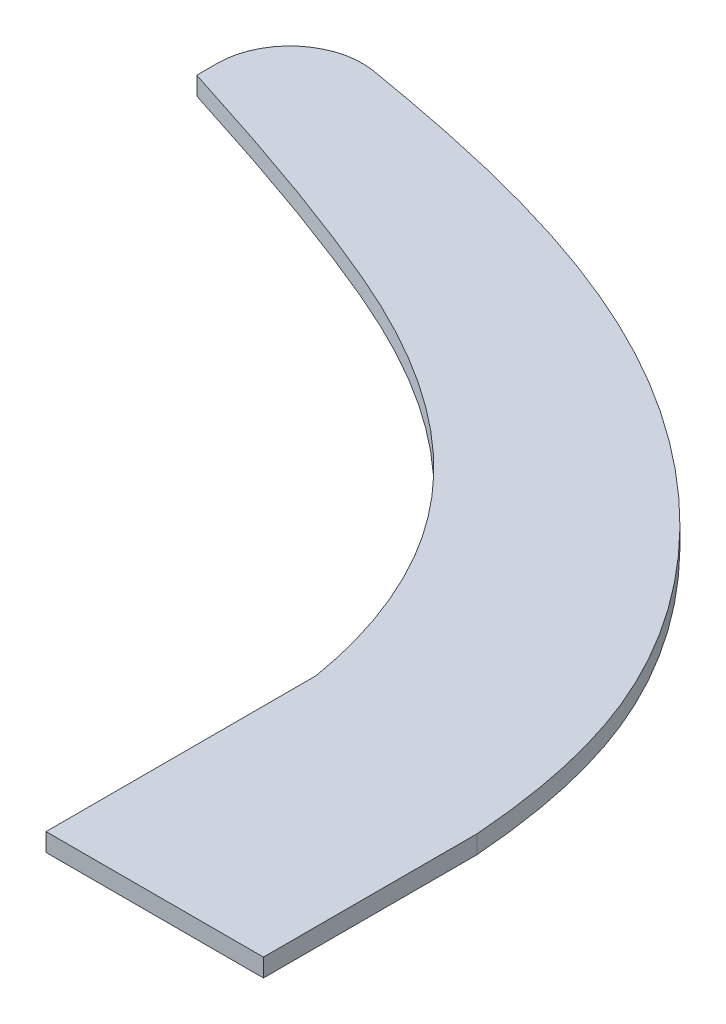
ISO-10303-21;
HEADER;
FILE_DESCRIPTION(('STEP AP214'),'2;1');
FILE_NAME('part.step','',(''),(''),'','','');
FILE_SCHEMA(('AUTOMOTIVE_DESIGN { 1 0 10303 214 1 1 1 1 }'));
ENDSEC;
DATA;
#1=APPLICATION_CONTEXT('core data for automotive mechanical design processes');
#2=APPLICATION_PROTOCOL_DEFINITION('international standard','automotive_design',2000,#1);
#3=PRODUCT_CONTEXT('',#1,'mechanical');
#4=PRODUCT('Part','Part','',(#3));
#5=PRODUCT_RELATED_PRODUCT_CATEGORY('part','',(#4));
#6=PRODUCT_DEFINITION_FORMATION('','',#4);
#7=PRODUCT_DEFINITION_CONTEXT('part definition',#1,'design');
#8=PRODUCT_DEFINITION('design','',#6,#7);
#9=PRODUCT_DEFINITION_SHAPE('','',#8);
#10=(LENGTH_UNIT() NAMED_UNIT(*) SI_UNIT(.MILLI.,.METRE.));
#11=(NAMED_UNIT(*) PLANE_ANGLE_UNIT() SI_UNIT($,.RADIAN.));
#12=(NAMED_UNIT(*) SI_UNIT($,.STERADIAN.) SOLID_ANGLE_UNIT());
#13=UNCERTAINTY_MEASURE_WITH_UNIT(LENGTH_MEASURE(1.E-05),#10,'distance_accuracy_value','');
#14=(GEOMETRIC_REPRESENTATION_CONTEXT(3) GLOBAL_UNCERTAINTY_ASSIGNED_CONTEXT((#13)) GLOBAL_UNIT_ASSIGNED_CONTEXT((#10,
#11,#12)) REPRESENTATION_CONTEXT('',''));
#15=CARTESIAN_POINT('',(0.,0.,0.));
#16=DIRECTION('',(0.,0.,1.));
#17=DIRECTION('',(1.,0.,0.));
#18=AXIS2_PLACEMENT_3D('',#15,#16,#17);
#19=CARTESIAN_POINT('',(-276.080212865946,6.35,-304.304256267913));
#20=CARTESIAN_POINT('',(-249.39702884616,6.35,-295.816675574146));
#21=CARTESIAN_POINT('',(-215.313087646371,6.35,-284.497873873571));
#22=CARTESIAN_POINT('',(-147.777683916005,6.35,-255.872844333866));
#23=CARTESIAN_POINT('',(-106.217359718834,6.35,-225.424204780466));
#24=CARTESIAN_POINT('',(-80.1625209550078,6.35,-174.044765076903));
#25=CARTESIAN_POINT('',(-75.0894864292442,6.35,-155.98481076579));
#26=CARTESIAN_POINT('',(-72.8802128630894,6.35,-142.977188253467));
#27=B_SPLINE_CURVE_WITH_KNOTS('',3,(#19,#20,#21,#22,#23,#24,#25,#26),.UNSPECIFIED.,.F.,.F.,(4,1,
1,1,1,4),(0.204924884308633,0.390633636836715,0.440251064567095,0.672116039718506,
0.710668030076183,0.796787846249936),.UNSPECIFIED.);
#28=DIRECTION('',(0.,-1.,0.));
#29=VECTOR('',#28,1.);
#30=SURFACE_OF_LINEAR_EXTRUSION('',#27,#29);
#31=CARTESIAN_POINT('',(-276.080212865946,0.,-304.304256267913));
#32=CARTESIAN_POINT('',(-249.39702884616,0.,-295.816675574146));
#33=CARTESIAN_POINT('',(-215.313087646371,0.,-284.497873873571));
#34=CARTESIAN_POINT('',(-147.777683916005,0.,-255.872844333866));
#35=CARTESIAN_POINT('',(-106.217359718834,0.,-225.424204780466));
#36=CARTESIAN_POINT('',(-80.1625209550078,0.,-174.044765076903));
#37=CARTESIAN_POINT('',(-75.0894864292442,0.,-155.98481076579));
#38=CARTESIAN_POINT('',(-72.8802128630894,0.,-142.977188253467));
#39=B_SPLINE_CURVE_WITH_KNOTS('',3,(#31,#32,#33,#34,#35,#36,#37,#38),.UNSPECIFIED.,.F.,.F.,(4,1,
1,1,1,4),(0.204924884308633,0.390633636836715,0.440251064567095,0.672116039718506,
0.710668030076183,0.796787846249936),.UNSPECIFIED.);
#40=CARTESIAN_POINT('',(-276.080212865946,0.,-304.304256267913));
#41=VERTEX_POINT('',#40);
#42=CARTESIAN_POINT('',(-72.8802128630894,0.,-142.977188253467));
#43=VERTEX_POINT('',#42);
#44=EDGE_CURVE('E125',#41,#43,#39,.T.);
#45=ORIENTED_EDGE('',*,*,#44,.T.);
#46=DIRECTION('',(0.,-1.,0.));
#47=VECTOR('',#46,1.);
#48=CARTESIAN_POINT('',(-72.8802128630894,6.35,-142.977188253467));
#49=LINE('',#48,#47);
#50=CARTESIAN_POINT('',(-72.8802128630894,6.35,-142.977188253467));
#51=VERTEX_POINT('',#50);
#52=EDGE_CURVE('E11',#51,#43,#49,.T.);
#53=ORIENTED_EDGE('',*,*,#52,.F.);
#54=CARTESIAN_POINT('',(-276.080212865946,6.35,-304.304256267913));
#55=VERTEX_POINT('',#54);
#56=EDGE_CURVE('E147',#55,#51,#27,.T.);
#57=ORIENTED_EDGE('',*,*,#56,.F.);
#58=DIRECTION('',(0.,-1.,0.));
#59=VECTOR('',#58,1.);
#60=CARTESIAN_POINT('',(-276.080212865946,6.35,-304.304256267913));
#61=LINE('',#60,#59);
#62=EDGE_CURVE('E118',#55,#41,#61,.T.);
#63=ORIENTED_EDGE('',*,*,#62,.T.);
#64=EDGE_LOOP('',(#45,#53,#57,#63));
#65=FACE_BOUND('',#64,.T.);
#66=ADVANCED_FACE('F31',(#65),#30,.F.);
#67=CARTESIAN_POINT('',(-72.8802128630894,6.35,-48.26));
#68=DIRECTION('',(1.,0.,0.));
#69=DIRECTION('',(0.,0.,-1.));
#70=AXIS2_PLACEMENT_3D('',#67,#68,#69);
#71=PLANE('',#70);
#72=DIRECTION('',(0.,0.,1.));
#73=VECTOR('',#72,1.);
#74=CARTESIAN_POINT('',(-72.8802128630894,0.,-48.26));
#75=LINE('',#74,#73);
#76=CARTESIAN_POINT('',(-72.8802128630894,0.,-48.26));
#77=VERTEX_POINT('',#76);
#78=EDGE_CURVE('E130',#43,#77,#75,.T.);
#79=ORIENTED_EDGE('',*,*,#78,.T.);
#80=DIRECTION('',(0.,-1.,0.));
#81=VECTOR('',#80,1.);
#82=CARTESIAN_POINT('',(-72.8802128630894,6.35,-48.26));
#83=LINE('',#82,#81);
#84=CARTESIAN_POINT('',(-72.8802128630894,6.35,-48.26));
#85=VERTEX_POINT('',#84);
#86=EDGE_CURVE('E40',#85,#77,#83,.T.);
#87=ORIENTED_EDGE('',*,*,#86,.F.);
#88=DIRECTION('',(0.,0.,1.));
#89=VECTOR('',#88,1.);
#90=CARTESIAN_POINT('',(-72.8802128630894,6.35,-48.26));
#91=LINE('',#90,#89);
#92=EDGE_CURVE('E88',#51,#85,#91,.T.);
#93=ORIENTED_EDGE('',*,*,#92,.F.);
#94=ORIENTED_EDGE('',*,*,#52,.T.);
#95=EDGE_LOOP('',(#79,#87,#93,#94));
#96=FACE_BOUND('',#95,.T.);
#97=ADVANCED_FACE('F177',(#96),#71,.F.);
#98=CARTESIAN_POINT('',(3.31978713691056,6.35,-48.26));
#99=DIRECTION('',(0.,0.,-1.));
#100=DIRECTION('',(-1.,0.,0.));
#101=AXIS2_PLACEMENT_3D('',#98,#99,#100);
#102=PLANE('',#101);
#103=DIRECTION('',(1.,0.,0.));
#104=VECTOR('',#103,1.);
#105=CARTESIAN_POINT('',(3.31978713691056,0.,-48.26));
#106=LINE('',#105,#104);
#107=CARTESIAN_POINT('',(3.31978713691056,0.,-48.26));
#108=VERTEX_POINT('',#107);
#109=EDGE_CURVE('E135',#77,#108,#106,.T.);
#110=ORIENTED_EDGE('',*,*,#109,.T.);
#111=DIRECTION('',(0.,-1.,0.));
#112=VECTOR('',#111,1.);
#113=CARTESIAN_POINT('',(3.31978713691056,6.35,-48.26));
#114=LINE('',#113,#112);
#115=CARTESIAN_POINT('',(3.31978713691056,6.35,-48.26));
#116=VERTEX_POINT('',#115);
#117=EDGE_CURVE('E151',#116,#108,#114,.T.);
#118=ORIENTED_EDGE('',*,*,#117,.F.);
#119=DIRECTION('',(1.,0.,0.));
#120=VECTOR('',#119,1.);
#121=CARTESIAN_POINT('',(3.31978713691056,6.35,-48.26));
#122=LINE('',#121,#120);
#123=EDGE_CURVE('E159',#85,#116,#122,.T.);
#124=ORIENTED_EDGE('',*,*,#123,.F.);
#125=ORIENTED_EDGE('',*,*,#86,.T.);
#126=EDGE_LOOP('',(#110,#118,#124,#125));
#127=FACE_BOUND('',#126,.T.);
#128=ADVANCED_FACE('F157',(#127),#102,.F.);
#129=CARTESIAN_POINT('',(3.31978713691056,6.35,-48.26));
#130=DIRECTION('',(-1.,0.,0.));
#131=DIRECTION('',(0.,0.,1.));
#132=AXIS2_PLACEMENT_3D('',#129,#130,#131);
#133=PLANE('',#132);
#134=DIRECTION('',(0.,0.,-1.));
#135=VECTOR('',#134,1.);
#136=CARTESIAN_POINT('',(3.31978713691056,0.,-48.26));
#137=LINE('',#136,#135);
#138=CARTESIAN_POINT('',(3.31978713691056,0.,-123.182472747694));
#139=VERTEX_POINT('',#138);
#140=EDGE_CURVE('E137',#108,#139,#137,.T.);
#141=ORIENTED_EDGE('',*,*,#140,.T.);
#142=DIRECTION('',(0.,-1.,0.));
#143=VECTOR('',#142,1.);
#144=CARTESIAN_POINT('',(3.31978713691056,6.35,-123.182472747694));
#145=LINE('',#144,#143);
#146=CARTESIAN_POINT('',(3.31978713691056,6.35,-123.182472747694));
#147=VERTEX_POINT('',#146);
#148=EDGE_CURVE('E113',#147,#139,#145,.T.);
#149=ORIENTED_EDGE('',*,*,#148,.F.);
#150=DIRECTION('',(0.,0.,-1.));
#151=VECTOR('',#150,1.);
#152=CARTESIAN_POINT('',(3.31978713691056,6.35,-48.26));
#153=LINE('',#152,#151);
#154=EDGE_CURVE('E104',#116,#147,#153,.T.);
#155=ORIENTED_EDGE('',*,*,#154,.F.);
#156=ORIENTED_EDGE('',*,*,#117,.T.);
#157=EDGE_LOOP('',(#141,#149,#155,#156));
#158=FACE_BOUND('',#157,.T.);
#159=ADVANCED_FACE('F165',(#158),#133,.F.);
#160=CARTESIAN_POINT('',(3.31978713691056,6.35,-123.182472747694));
#161=CARTESIAN_POINT('',(1.72995999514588,6.35,-144.350911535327));
#162=CARTESIAN_POINT('',(-10.6377479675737,6.35,-212.558405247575));
#163=CARTESIAN_POINT('',(-101.308396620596,6.35,-305.399197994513));
#164=CARTESIAN_POINT('',(-196.449017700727,6.35,-328.131034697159));
#165=CARTESIAN_POINT('',(-246.452645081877,6.35,-336.571350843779));
#166=B_SPLINE_CURVE_WITH_KNOTS('',3,(#160,#161,#162,#163,#164,#165),.UNSPECIFIED.,.F.,.F.,(4,1,
1,4),(0.156420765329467,0.291931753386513,0.595968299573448,0.916312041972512),.UNSPECIFIED.);
#167=DIRECTION('',(0.,-1.,0.));
#168=VECTOR('',#167,1.);
#169=SURFACE_OF_LINEAR_EXTRUSION('',#166,#168);
#170=CARTESIAN_POINT('',(3.31978713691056,0.,-123.182472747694));
#171=CARTESIAN_POINT('',(1.72995999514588,0.,-144.350911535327));
#172=CARTESIAN_POINT('',(-10.6377479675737,0.,-212.558405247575));
#173=CARTESIAN_POINT('',(-101.308396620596,0.,-305.399197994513));
#174=CARTESIAN_POINT('',(-196.449017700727,0.,-328.131034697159));
#175=CARTESIAN_POINT('',(-246.452645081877,0.,-336.571350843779));
#176=B_SPLINE_CURVE_WITH_KNOTS('',3,(#170,#171,#172,#173,#174,#175),.UNSPECIFIED.,.F.,.F.,(4,1,
1,4),(0.156420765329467,0.291931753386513,0.595968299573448,0.916312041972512),.UNSPECIFIED.);
#177=CARTESIAN_POINT('',(-246.452645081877,0.,-336.571350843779));
#178=VERTEX_POINT('',#177);
#179=EDGE_CURVE('E112',#139,#178,#176,.T.);
#180=ORIENTED_EDGE('',*,*,#179,.T.);
#181=DIRECTION('',(0.,-1.,0.));
#182=VECTOR('',#181,1.);
#183=CARTESIAN_POINT('',(-246.452645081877,6.35,-336.571350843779));
#184=LINE('',#183,#182);
#185=CARTESIAN_POINT('',(-246.452645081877,6.35,-336.571350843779));
#186=VERTEX_POINT('',#185);
#187=EDGE_CURVE('E109',#186,#178,#184,.T.);
#188=ORIENTED_EDGE('',*,*,#187,.F.);
#189=EDGE_CURVE('E98',#147,#186,#166,.T.);
#190=ORIENTED_EDGE('',*,*,#189,.F.);
#191=ORIENTED_EDGE('',*,*,#148,.T.);
#192=EDGE_LOOP('',(#180,#188,#190,#191));
#193=FACE_BOUND('',#192,.T.);
#194=ADVANCED_FACE('F110',(#193),#169,.F.);
#195=CARTESIAN_POINT('',(-250.680212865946,6.35,-311.525639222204));
#196=DIRECTION('',(0.,-1.,0.));
#197=DIRECTION('',(0.,0.,-1.));
#198=AXIS2_PLACEMENT_3D('',#195,#196,#197);
#199=CYLINDRICAL_SURFACE('',#198,25.4);
#200=CARTESIAN_POINT('',(-250.680212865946,0.,-311.525639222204));
#201=DIRECTION('',(0.,1.,0.));
#202=DIRECTION('',(0.,0.,1.));
#203=AXIS2_PLACEMENT_3D('',#200,#201,#202);
#204=CIRCLE('',#203,25.4);
#205=CARTESIAN_POINT('',(-276.080212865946,0.,-311.525639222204));
#206=VERTEX_POINT('',#205);
#207=EDGE_CURVE('E74',#178,#206,#204,.T.);
#208=ORIENTED_EDGE('',*,*,#207,.T.);
#209=DIRECTION('',(0.,-1.,0.));
#210=VECTOR('',#209,1.);
#211=CARTESIAN_POINT('',(-276.080212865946,6.35,-311.525639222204));
#212=LINE('',#211,#210);
#213=CARTESIAN_POINT('',(-276.080212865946,6.35,-311.525639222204));
#214=VERTEX_POINT('',#213);
#215=EDGE_CURVE('E114',#214,#206,#212,.T.);
#216=ORIENTED_EDGE('',*,*,#215,.F.);
#217=CARTESIAN_POINT('',(-250.680212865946,6.35,-311.525639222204));
#218=DIRECTION('',(0.,1.,0.));
#219=DIRECTION('',(0.,0.,1.));
#220=AXIS2_PLACEMENT_3D('',#217,#218,#219);
#221=CIRCLE('',#220,25.4);
#222=EDGE_CURVE('E102',#186,#214,#221,.T.);
#223=ORIENTED_EDGE('',*,*,#222,.F.);
#224=ORIENTED_EDGE('',*,*,#187,.T.);
#225=EDGE_LOOP('',(#208,#216,#223,#224));
#226=FACE_BOUND('',#225,.T.);
#227=ADVANCED_FACE('F116',(#226),#199,.T.);
#228=CARTESIAN_POINT('',(-276.080212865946,6.35,-304.304256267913));
#229=DIRECTION('',(1.,0.,0.));
#230=DIRECTION('',(0.,0.,-1.));
#231=AXIS2_PLACEMENT_3D('',#228,#229,#230);
#232=PLANE('',#231);
#233=DIRECTION('',(0.,0.,1.));
#234=VECTOR('',#233,1.);
#235=CARTESIAN_POINT('',(-276.080212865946,0.,-304.304256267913));
#236=LINE('',#235,#234);
#237=EDGE_CURVE('E80',#206,#41,#236,.T.);
#238=ORIENTED_EDGE('',*,*,#237,.T.);
#239=ORIENTED_EDGE('',*,*,#62,.F.);
#240=DIRECTION('',(0.,0.,1.));
#241=VECTOR('',#240,1.);
#242=CARTESIAN_POINT('',(-276.080212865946,6.35,-304.304256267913));
#243=LINE('',#242,#241);
#244=EDGE_CURVE('E48',#214,#55,#243,.T.);
#245=ORIENTED_EDGE('',*,*,#244,.F.);
#246=ORIENTED_EDGE('',*,*,#215,.T.);
#247=EDGE_LOOP('',(#238,#239,#245,#246));
#248=FACE_BOUND('',#247,.T.);
#249=ADVANCED_FACE('F191',(#248),#232,.F.);
#250=CARTESIAN_POINT('',(-149.166240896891,6.35,-253.133254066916));
#251=DIRECTION('',(0.,-1.,0.));
#252=DIRECTION('',(0.,0.,-1.));
#253=AXIS2_PLACEMENT_3D('',#250,#251,#252);
#254=PLANE('',#253);
#255=ORIENTED_EDGE('',*,*,#56,.T.);
#256=ORIENTED_EDGE('',*,*,#92,.T.);
#257=ORIENTED_EDGE('',*,*,#123,.T.);
#258=ORIENTED_EDGE('',*,*,#154,.T.);
#259=ORIENTED_EDGE('',*,*,#189,.T.);
#260=ORIENTED_EDGE('',*,*,#222,.T.);
#261=ORIENTED_EDGE('',*,*,#244,.T.);
#262=EDGE_LOOP('',(#255,#256,#257,#258,#259,#260,#261));
#263=FACE_BOUND('',#262,.T.);
#264=ADVANCED_FACE('F100',(#263),#254,.F.);
#265=CARTESIAN_POINT('',(-149.166240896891,0.,-253.133254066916));
#266=DIRECTION('',(0.,-1.,0.));
#267=DIRECTION('',(0.,0.,-1.));
#268=AXIS2_PLACEMENT_3D('',#265,#266,#267);
#269=PLANE('',#268);
#270=ORIENTED_EDGE('',*,*,#44,.F.);
#271=ORIENTED_EDGE('',*,*,#237,.F.);
#272=ORIENTED_EDGE('',*,*,#207,.F.);
#273=ORIENTED_EDGE('',*,*,#179,.F.);
#274=ORIENTED_EDGE('',*,*,#140,.F.);
#275=ORIENTED_EDGE('',*,*,#109,.F.);
#276=ORIENTED_EDGE('',*,*,#78,.F.);
#277=EDGE_LOOP('',(#270,#271,#272,#273,#274,#275,#276));
#278=FACE_BOUND('',#277,.T.);
#279=ADVANCED_FACE('F163',(#278),#269,.T.);
#280=CLOSED_SHELL('',(#66,#97,#128,#159,#194,#227,#249,#264,#279));
#281=MANIFOLD_SOLID_BREP('B2',#280);
#282=ADVANCED_BREP_SHAPE_REPRESENTATION('',(#18,#281),#14);
#283=SHAPE_DEFINITION_REPRESENTATION(#9,#282);
ENDSEC;
END-ISO-10303-21;
